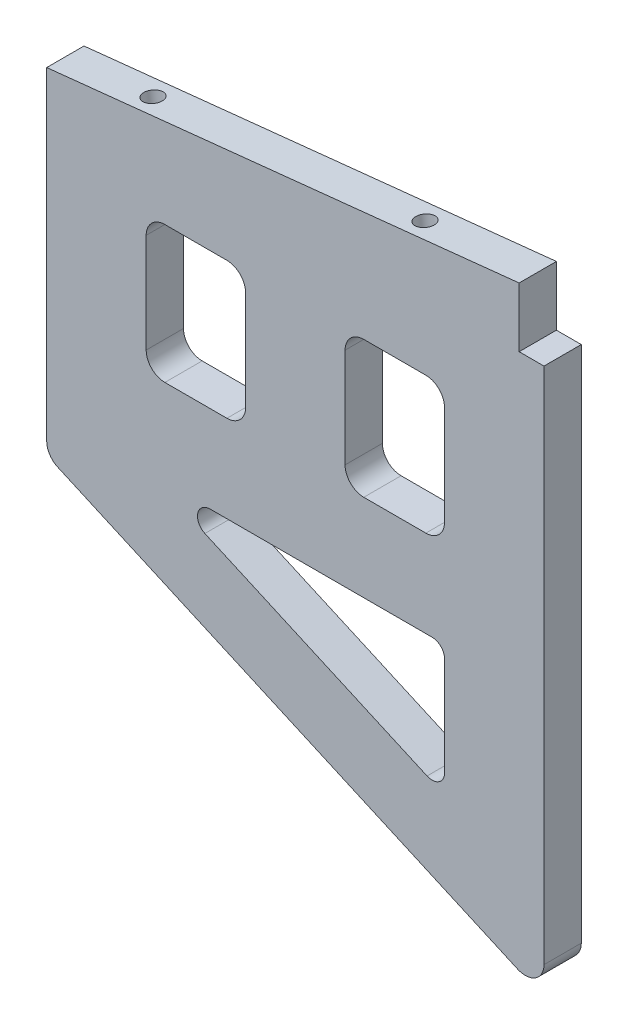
from build123d import *

# Parameters (mm, degrees)
SKETCH2_W                          = 25.4
SKETCH2_H                          = 34.925
BOSS_EXTRUDE1_DEPTH                = 4.7625
F_3_16_0_1875_DIAMETER_HOLE1_D     = 4.7625
F_3_16_0_1875_DIAMETER_HOLE1_DEPTH = 19.05
F_3_16_0_1875_DIAMETER_HOLE1_TIP   = 1.430799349
FILLET1_R                          = 3.175
FILLET2_R                          = 4.7752
FILLET3_R                          = 4.7752


with BuildPart() as part:
    # Sketch2 → Boss-Extrude1 (new, symmetric)
    with BuildSketch(Plane.XY):
        Polygon((0, -85.725), (127, -142.269043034), (127, -2.526762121), (120.65, -2.526762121), (120.65, 12.680825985), (0, 0), align=None)
        Polygon((26.751273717, -76.782613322), (101.6, -110.107413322), (101.6, -76.782613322), align=None, mode=Mode.SUBTRACT)
        with Locations((38.1, -37.095113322)):
            Rectangle(SKETCH2_W, SKETCH2_H, mode=Mode.SUBTRACT)
        with Locations((88.9, -37.095113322)):
            Rectangle(SKETCH2_W, SKETCH2_H, mode=Mode.SUBTRACT)
    extrude(amount=BOSS_EXTRUDE1_DEPTH, both=True)

    # 3_16 _0.1875_ Diameter Hole1
    with Locations(Plane(origin=(0, 0, 0), x_dir=(0.9945218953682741, 0.10452846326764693, 0), z_dir=(-0.10452846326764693, 0.9945218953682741, 0))):
        with Locations((22.5044, 0), (92.3544, 0)):
            Hole(F_3_16_0_1875_DIAMETER_HOLE1_D / 2, depth=F_3_16_0_1875_DIAMETER_HOLE1_DEPTH)
            with Locations((0, 0, -(F_3_16_0_1875_DIAMETER_HOLE1_DEPTH + F_3_16_0_1875_DIAMETER_HOLE1_TIP / 2))):  # 118° drill point
                Cone(0, F_3_16_0_1875_DIAMETER_HOLE1_D / 2, F_3_16_0_1875_DIAMETER_HOLE1_TIP, mode=Mode.SUBTRACT)

    # Fillet1
    fillet1_edges = [part.edges().sort_by_distance(p)[0] for p in [
        (101.6, -76.782613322, 0),
        (26.751273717, -76.782613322, 0),
        (101.6, -110.107413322, 0),
    ]]
    fillet(fillet1_edges, radius=FILLET1_R)

    # Fillet2
    fillet2_edges = [part.edges().sort_by_distance(p)[0] for p in [
        (25.4, -19.632613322, 0),
        (25.4, -54.557613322, 0),
        (50.8, -54.557613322, 0),
        (50.8, -19.632613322, 0),
        (76.2, -19.632613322, 0),
        (76.2, -54.557613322, 0),
        (101.6, -54.557613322, 0),
        (101.6, -19.632613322, 0),
    ]]
    fillet(fillet2_edges, radius=FILLET2_R)

    # Fillet3
    fillet3_edges = [part.edges().sort_by_distance(p)[0] for p in [
        (127, -142.269043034, 0),
        (0, -85.725, 0),
    ]]
    fillet(fillet3_edges, radius=FILLET3_R)


solid = part.part
